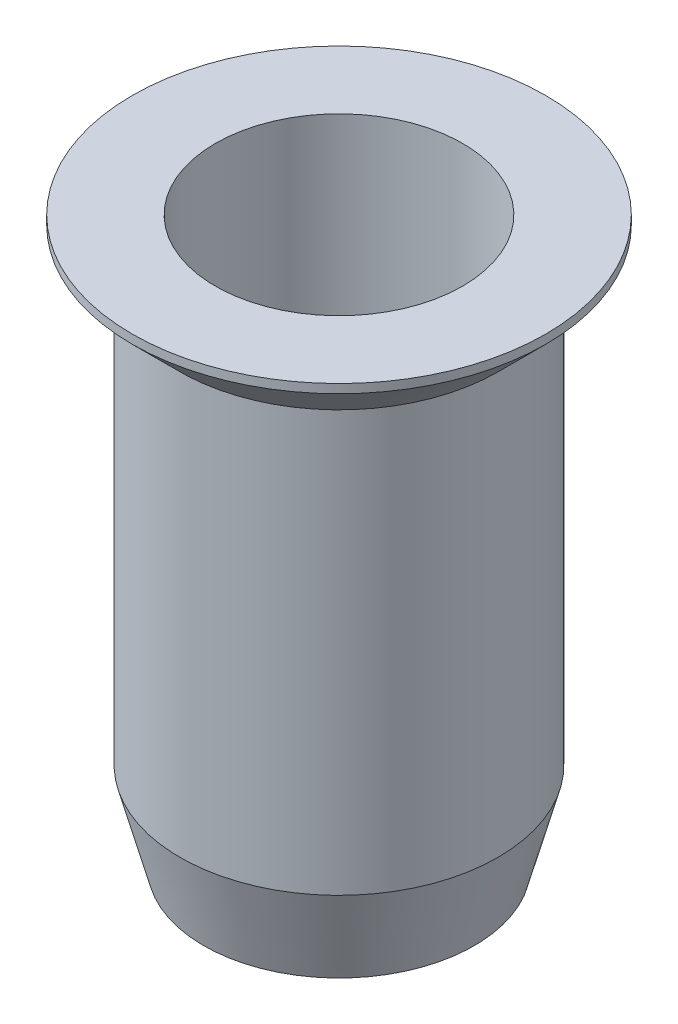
ISO-10303-21;
HEADER;
FILE_DESCRIPTION(('STEP AP214'),'2;1');
FILE_NAME('part.step','',(''),(''),'','','');
FILE_SCHEMA(('AUTOMOTIVE_DESIGN { 1 0 10303 214 1 1 1 1 }'));
ENDSEC;
DATA;
#1=APPLICATION_CONTEXT('core data for automotive mechanical design processes');
#2=APPLICATION_PROTOCOL_DEFINITION('international standard','automotive_design',2000,#1);
#3=PRODUCT_CONTEXT('',#1,'mechanical');
#4=PRODUCT('Part','Part','',(#3));
#5=PRODUCT_RELATED_PRODUCT_CATEGORY('part','',(#4));
#6=PRODUCT_DEFINITION_FORMATION('','',#4);
#7=PRODUCT_DEFINITION_CONTEXT('part definition',#1,'design');
#8=PRODUCT_DEFINITION('design','',#6,#7);
#9=PRODUCT_DEFINITION_SHAPE('','',#8);
#10=(LENGTH_UNIT() NAMED_UNIT(*) SI_UNIT(.MILLI.,.METRE.));
#11=(NAMED_UNIT(*) PLANE_ANGLE_UNIT() SI_UNIT($,.RADIAN.));
#12=(NAMED_UNIT(*) SI_UNIT($,.STERADIAN.) SOLID_ANGLE_UNIT());
#13=UNCERTAINTY_MEASURE_WITH_UNIT(LENGTH_MEASURE(1.E-05),#10,'distance_accuracy_value','');
#14=(GEOMETRIC_REPRESENTATION_CONTEXT(3) GLOBAL_UNCERTAINTY_ASSIGNED_CONTEXT((#13)) GLOBAL_UNIT_ASSIGNED_CONTEXT((#10,
#11,#12)) REPRESENTATION_CONTEXT('',''));
#15=CARTESIAN_POINT('',(0.,0.,0.));
#16=DIRECTION('',(0.,0.,1.));
#17=DIRECTION('',(1.,0.,0.));
#18=AXIS2_PLACEMENT_3D('',#15,#16,#17);
#19=CARTESIAN_POINT('',(0.,0.,0.));
#20=DIRECTION('',(0.,1.,0.));
#21=DIRECTION('',(-1.,0.,0.));
#22=AXIS2_PLACEMENT_3D('',#19,#20,#21);
#23=CYLINDRICAL_SURFACE('',#22,3.5);
#24=CARTESIAN_POINT('',(0.,-7.,0.));
#25=DIRECTION('',(0.,1.,0.));
#26=DIRECTION('',(-1.,0.,0.));
#27=AXIS2_PLACEMENT_3D('',#24,#25,#26);
#28=CIRCLE('',#27,3.5);
#29=CARTESIAN_POINT('',(-3.5,-7.,0.));
#30=VERTEX_POINT('',#29);
#31=EDGE_CURVE('E73',#30,#30,#28,.T.);
#32=ORIENTED_EDGE('',*,*,#31,.F.);
#33=EDGE_LOOP('',(#32));
#34=FACE_BOUND('',#33,.T.);
#35=CARTESIAN_POINT('',(0.,0.,0.));
#36=DIRECTION('',(0.,1.,0.));
#37=DIRECTION('',(-1.,0.,0.));
#38=AXIS2_PLACEMENT_3D('',#35,#36,#37);
#39=CIRCLE('',#38,3.5);
#40=CARTESIAN_POINT('',(-3.5,0.,0.));
#41=VERTEX_POINT('',#40);
#42=EDGE_CURVE('E10',#41,#41,#39,.T.);
#43=ORIENTED_EDGE('',*,*,#42,.T.);
#44=EDGE_LOOP('',(#43));
#45=FACE_BOUND('',#44,.T.);
#46=ADVANCED_FACE('F34',(#34,#45),#23,.F.);
#47=CARTESIAN_POINT('',(3.5,0.,0.));
#48=DIRECTION('',(0.,-1.,0.));
#49=DIRECTION('',(1.,0.,0.));
#50=AXIS2_PLACEMENT_3D('',#47,#48,#49);
#51=PLANE('',#50);
#52=ORIENTED_EDGE('',*,*,#42,.F.);
#53=EDGE_LOOP('',(#52));
#54=FACE_BOUND('',#53,.T.);
#55=CARTESIAN_POINT('',(0.,0.,0.));
#56=DIRECTION('',(0.,1.,0.));
#57=DIRECTION('',(-1.,0.,0.));
#58=AXIS2_PLACEMENT_3D('',#55,#56,#57);
#59=CIRCLE('',#58,5.85);
#60=CARTESIAN_POINT('',(-5.85,0.,0.));
#61=VERTEX_POINT('',#60);
#62=EDGE_CURVE('E41',#61,#61,#59,.T.);
#63=ORIENTED_EDGE('',*,*,#62,.T.);
#64=EDGE_LOOP('',(#63));
#65=FACE_BOUND('',#64,.T.);
#66=ADVANCED_FACE('F81',(#54,#65),#51,.F.);
#67=CARTESIAN_POINT('',(0.,0.,0.));
#68=DIRECTION('',(0.,1.,0.));
#69=DIRECTION('',(-1.,0.,0.));
#70=AXIS2_PLACEMENT_3D('',#67,#68,#69);
#71=CYLINDRICAL_SURFACE('',#70,5.85);
#72=ORIENTED_EDGE('',*,*,#62,.F.);
#73=EDGE_LOOP('',(#72));
#74=FACE_BOUND('',#73,.T.);
#75=CARTESIAN_POINT('',(0.,-0.250000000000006,0.));
#76=DIRECTION('',(0.,1.,0.));
#77=DIRECTION('',(-1.,0.,0.));
#78=AXIS2_PLACEMENT_3D('',#75,#76,#77);
#79=CIRCLE('',#78,5.85);
#80=CARTESIAN_POINT('',(-5.85,-0.250000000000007,0.));
#81=VERTEX_POINT('',#80);
#82=EDGE_CURVE('E46',#81,#81,#79,.T.);
#83=ORIENTED_EDGE('',*,*,#82,.T.);
#84=EDGE_LOOP('',(#83));
#85=FACE_BOUND('',#84,.T.);
#86=ADVANCED_FACE('F85',(#74,#85),#71,.T.);
#87=CARTESIAN_POINT('',(0.,-1.6,0.));
#88=DIRECTION('',(0.,1.,0.));
#89=DIRECTION('',(-1.,0.,0.));
#90=AXIS2_PLACEMENT_3D('',#87,#88,#89);
#91=CONICAL_SURFACE('',#90,4.5,0.78539816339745);
#92=ORIENTED_EDGE('',*,*,#82,.F.);
#93=EDGE_LOOP('',(#92));
#94=FACE_BOUND('',#93,.T.);
#95=CARTESIAN_POINT('',(0.,-1.6,0.));
#96=DIRECTION('',(0.,1.,0.));
#97=DIRECTION('',(-1.,0.,0.));
#98=AXIS2_PLACEMENT_3D('',#95,#96,#97);
#99=CIRCLE('',#98,4.5);
#100=CARTESIAN_POINT('',(-4.5,-1.6,0.));
#101=VERTEX_POINT('',#100);
#102=EDGE_CURVE('E51',#101,#101,#99,.T.);
#103=ORIENTED_EDGE('',*,*,#102,.T.);
#104=EDGE_LOOP('',(#103));
#105=FACE_BOUND('',#104,.T.);
#106=ADVANCED_FACE('F90',(#94,#105),#91,.T.);
#107=CARTESIAN_POINT('',(0.,0.,0.));
#108=DIRECTION('',(0.,1.,0.));
#109=DIRECTION('',(-1.,0.,0.));
#110=AXIS2_PLACEMENT_3D('',#107,#108,#109);
#111=CYLINDRICAL_SURFACE('',#110,4.5);
#112=ORIENTED_EDGE('',*,*,#102,.F.);
#113=EDGE_LOOP('',(#112));
#114=FACE_BOUND('',#113,.T.);
#115=CARTESIAN_POINT('',(0.,-13.5,0.));
#116=DIRECTION('',(0.,1.,0.));
#117=DIRECTION('',(-1.,0.,0.));
#118=AXIS2_PLACEMENT_3D('',#115,#116,#117);
#119=CIRCLE('',#118,4.5);
#120=CARTESIAN_POINT('',(-4.5,-13.5,0.));
#121=VERTEX_POINT('',#120);
#122=EDGE_CURVE('E57',#121,#121,#119,.T.);
#123=ORIENTED_EDGE('',*,*,#122,.T.);
#124=EDGE_LOOP('',(#123));
#125=FACE_BOUND('',#124,.T.);
#126=ADVANCED_FACE('F95',(#114,#125),#111,.T.);
#127=CARTESIAN_POINT('',(0.,-16.,0.));
#128=DIRECTION('',(0.,1.,0.));
#129=DIRECTION('',(-1.,0.,0.));
#130=AXIS2_PLACEMENT_3D('',#127,#128,#129);
#131=CONICAL_SURFACE('',#130,3.83012701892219,0.26179938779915);
#132=ORIENTED_EDGE('',*,*,#122,.F.);
#133=EDGE_LOOP('',(#132));
#134=FACE_BOUND('',#133,.T.);
#135=CARTESIAN_POINT('',(0.,-16.,0.));
#136=DIRECTION('',(0.,1.,0.));
#137=DIRECTION('',(-1.,0.,0.));
#138=AXIS2_PLACEMENT_3D('',#135,#136,#137);
#139=CIRCLE('',#138,3.83012701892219);
#140=CARTESIAN_POINT('',(-3.83012701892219,-16.,0.));
#141=VERTEX_POINT('',#140);
#142=EDGE_CURVE('E61',#141,#141,#139,.T.);
#143=ORIENTED_EDGE('',*,*,#142,.T.);
#144=EDGE_LOOP('',(#143));
#145=FACE_BOUND('',#144,.T.);
#146=ADVANCED_FACE('F99',(#134,#145),#131,.T.);
#147=CARTESIAN_POINT('',(3.83012701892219,-16.,0.));
#148=DIRECTION('',(0.,1.,0.));
#149=DIRECTION('',(-1.,0.,0.));
#150=AXIS2_PLACEMENT_3D('',#147,#148,#149);
#151=PLANE('',#150);
#152=ORIENTED_EDGE('',*,*,#142,.F.);
#153=EDGE_LOOP('',(#152));
#154=FACE_BOUND('',#153,.T.);
#155=CARTESIAN_POINT('',(0.,-16.,0.));
#156=DIRECTION('',(0.,1.,0.));
#157=DIRECTION('',(-1.,0.,0.));
#158=AXIS2_PLACEMENT_3D('',#155,#156,#157);
#159=CIRCLE('',#158,3.);
#160=CARTESIAN_POINT('',(-3.,-16.,0.));
#161=VERTEX_POINT('',#160);
#162=EDGE_CURVE('E65',#161,#161,#159,.T.);
#163=ORIENTED_EDGE('',*,*,#162,.T.);
#164=EDGE_LOOP('',(#163));
#165=FACE_BOUND('',#164,.T.);
#166=ADVANCED_FACE('F103',(#154,#165),#151,.F.);
#167=CARTESIAN_POINT('',(0.,0.,0.));
#168=DIRECTION('',(0.,1.,0.));
#169=DIRECTION('',(-1.,0.,0.));
#170=AXIS2_PLACEMENT_3D('',#167,#168,#169);
#171=CYLINDRICAL_SURFACE('',#170,3.);
#172=ORIENTED_EDGE('',*,*,#162,.F.);
#173=EDGE_LOOP('',(#172));
#174=FACE_BOUND('',#173,.T.);
#175=CARTESIAN_POINT('',(0.,-7.28867513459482,0.));
#176=DIRECTION('',(0.,1.,0.));
#177=DIRECTION('',(-1.,0.,0.));
#178=AXIS2_PLACEMENT_3D('',#175,#176,#177);
#179=CIRCLE('',#178,3.);
#180=CARTESIAN_POINT('',(-3.,-7.28867513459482,0.));
#181=VERTEX_POINT('',#180);
#182=EDGE_CURVE('E69',#181,#181,#179,.T.);
#183=ORIENTED_EDGE('',*,*,#182,.T.);
#184=EDGE_LOOP('',(#183));
#185=FACE_BOUND('',#184,.T.);
#186=ADVANCED_FACE('F106',(#174,#185),#171,.F.);
#187=CARTESIAN_POINT('',(0.,-7.,0.));
#188=DIRECTION('',(0.,1.,0.));
#189=DIRECTION('',(-1.,0.,0.));
#190=AXIS2_PLACEMENT_3D('',#187,#188,#189);
#191=CONICAL_SURFACE('',#190,3.5,1.04719755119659);
#192=ORIENTED_EDGE('',*,*,#182,.F.);
#193=EDGE_LOOP('',(#192));
#194=FACE_BOUND('',#193,.T.);
#195=ORIENTED_EDGE('',*,*,#31,.T.);
#196=EDGE_LOOP('',(#195));
#197=FACE_BOUND('',#196,.T.);
#198=ADVANCED_FACE('F78',(#194,#197),#191,.F.);
#199=CLOSED_SHELL('',(#46,#66,#86,#106,#126,#146,#166,#186,#198));
#200=MANIFOLD_SOLID_BREP('B2',#199);
#201=ADVANCED_BREP_SHAPE_REPRESENTATION('',(#18,#200),#14);
#202=SHAPE_DEFINITION_REPRESENTATION(#9,#201);
ENDSEC;
END-ISO-10303-21;
